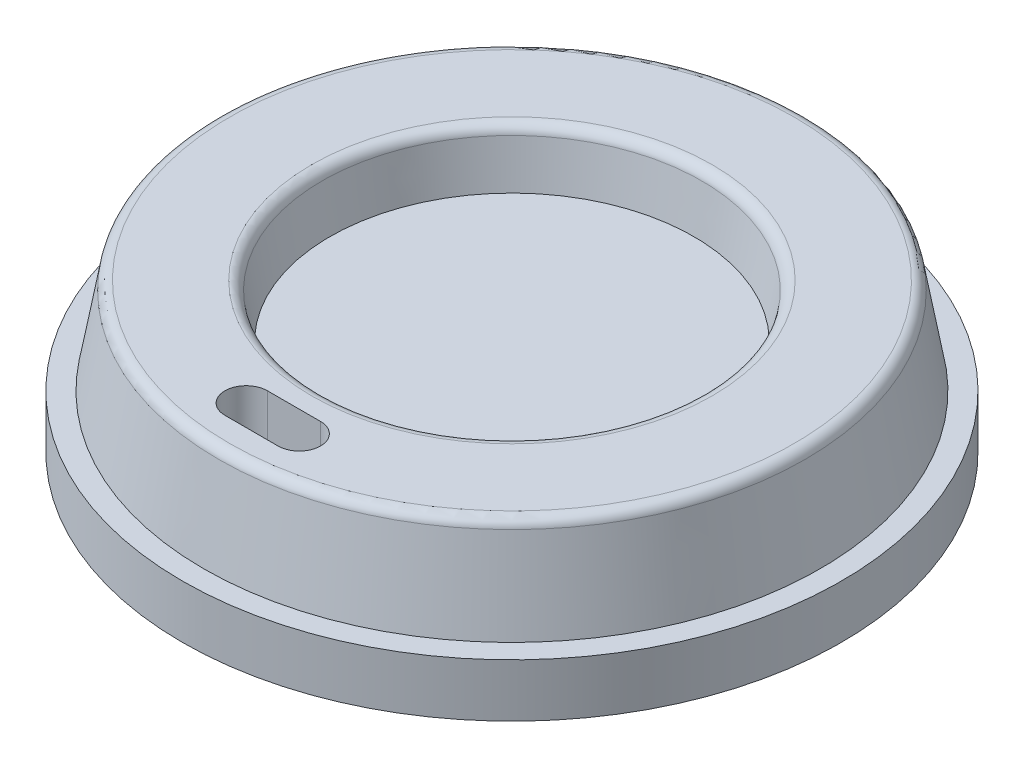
ISO-10303-21;
HEADER;
FILE_DESCRIPTION(('STEP AP214'),'2;1');
FILE_NAME('part.step','',(''),(''),'','','');
FILE_SCHEMA(('AUTOMOTIVE_DESIGN { 1 0 10303 214 1 1 1 1 }'));
ENDSEC;
DATA;
#1=APPLICATION_CONTEXT('core data for automotive mechanical design processes');
#2=APPLICATION_PROTOCOL_DEFINITION('international standard','automotive_design',2000,#1);
#3=PRODUCT_CONTEXT('',#1,'mechanical');
#4=PRODUCT('Part','Part','',(#3));
#5=PRODUCT_RELATED_PRODUCT_CATEGORY('part','',(#4));
#6=PRODUCT_DEFINITION_FORMATION('','',#4);
#7=PRODUCT_DEFINITION_CONTEXT('part definition',#1,'design');
#8=PRODUCT_DEFINITION('design','',#6,#7);
#9=PRODUCT_DEFINITION_SHAPE('','',#8);
#10=(LENGTH_UNIT() NAMED_UNIT(*) SI_UNIT(.MILLI.,.METRE.));
#11=(NAMED_UNIT(*) PLANE_ANGLE_UNIT() SI_UNIT($,.RADIAN.));
#12=(NAMED_UNIT(*) SI_UNIT($,.STERADIAN.) SOLID_ANGLE_UNIT());
#13=UNCERTAINTY_MEASURE_WITH_UNIT(LENGTH_MEASURE(1.E-05),#10,'distance_accuracy_value','');
#14=(GEOMETRIC_REPRESENTATION_CONTEXT(3) GLOBAL_UNCERTAINTY_ASSIGNED_CONTEXT((#13)) GLOBAL_UNIT_ASSIGNED_CONTEXT((#10,
#11,#12)) REPRESENTATION_CONTEXT('',''));
#15=CARTESIAN_POINT('',(0.,0.,0.));
#16=DIRECTION('',(0.,0.,1.));
#17=DIRECTION('',(1.,0.,0.));
#18=AXIS2_PLACEMENT_3D('',#15,#16,#17);
#19=CARTESIAN_POINT('',(0.,5.,0.));
#20=DIRECTION('',(0.,-1.,0.));
#21=DIRECTION('',(0.,0.,-1.));
#22=AXIS2_PLACEMENT_3D('',#19,#20,#21);
#23=CYLINDRICAL_SURFACE('',#22,23.);
#24=CARTESIAN_POINT('',(0.,0.,0.));
#25=DIRECTION('',(0.,1.,0.));
#26=DIRECTION('',(0.,0.,1.));
#27=AXIS2_PLACEMENT_3D('',#24,#25,#26);
#28=CIRCLE('',#27,23.);
#29=CARTESIAN_POINT('',(4.49922585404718,0.,22.5556415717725));
#30=VERTEX_POINT('',#29);
#31=CARTESIAN_POINT('',(-4.49922585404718,0.,22.5556415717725));
#32=VERTEX_POINT('',#31);
#33=EDGE_CURVE('E112',#30,#32,#28,.T.);
#34=ORIENTED_EDGE('',*,*,#33,.T.);
#35=DIRECTION('',(0.,1.,0.));
#36=VECTOR('',#35,1.);
#37=CARTESIAN_POINT('',(-4.49922585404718,9.5,22.5556415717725));
#38=LINE('',#37,#36);
#39=CARTESIAN_POINT('',(-4.49922585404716,5.,22.5556415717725));
#40=VERTEX_POINT('',#39);
#41=EDGE_CURVE('E137',#32,#40,#38,.T.);
#42=ORIENTED_EDGE('',*,*,#41,.T.);
#43=CARTESIAN_POINT('',(0.,5.,0.));
#44=DIRECTION('',(0.,1.,0.));
#45=DIRECTION('',(0.,0.,1.));
#46=AXIS2_PLACEMENT_3D('',#43,#44,#45);
#47=CIRCLE('',#46,23.);
#48=CARTESIAN_POINT('',(4.49922585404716,5.,22.5556415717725));
#49=VERTEX_POINT('',#48);
#50=EDGE_CURVE('E148',#49,#40,#47,.T.);
#51=ORIENTED_EDGE('',*,*,#50,.F.);
#52=DIRECTION('',(0.,1.,0.));
#53=VECTOR('',#52,1.);
#54=CARTESIAN_POINT('',(4.49922585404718,9.5,22.5556415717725));
#55=LINE('',#54,#53);
#56=EDGE_CURVE('E132',#49,#30,#55,.F.);
#57=ORIENTED_EDGE('',*,*,#56,.T.);
#58=EDGE_LOOP('',(#34,#42,#51,#57));
#59=FACE_BOUND('',#58,.T.);
#60=ADVANCED_FACE('F35',(#59),#23,.T.);
#61=CARTESIAN_POINT('',(0.,0.,0.));
#62=DIRECTION('',(0.,1.,0.));
#63=DIRECTION('',(0.,0.,1.));
#64=AXIS2_PLACEMENT_3D('',#61,#62,#63);
#65=PLANE('',#64);
#66=DIRECTION('',(-1.,0.,0.));
#67=VECTOR('',#66,1.);
#68=CARTESIAN_POINT('',(-2.5,0.,20.5));
#69=LINE('',#68,#67);
#70=CARTESIAN_POINT('',(2.5,0.,20.5));
#71=VERTEX_POINT('',#70);
#72=CARTESIAN_POINT('',(-2.5,0.,20.5));
#73=VERTEX_POINT('',#72);
#74=EDGE_CURVE('E102',#71,#73,#69,.T.);
#75=ORIENTED_EDGE('',*,*,#74,.T.);
#76=CARTESIAN_POINT('',(-2.5,0.,22.5));
#77=DIRECTION('',(0.,1.,0.));
#78=DIRECTION('',(0.,0.,1.));
#79=AXIS2_PLACEMENT_3D('',#76,#77,#78);
#80=CIRCLE('',#79,2.);
#81=EDGE_CURVE('E113',#73,#32,#80,.T.);
#82=ORIENTED_EDGE('',*,*,#81,.T.);
#83=ORIENTED_EDGE('',*,*,#33,.F.);
#84=CARTESIAN_POINT('',(2.5,0.,22.5));
#85=DIRECTION('',(0.,1.,0.));
#86=DIRECTION('',(0.,0.,1.));
#87=AXIS2_PLACEMENT_3D('',#84,#85,#86);
#88=CIRCLE('',#87,2.);
#89=EDGE_CURVE('E92',#30,#71,#88,.T.);
#90=ORIENTED_EDGE('',*,*,#89,.T.);
#91=EDGE_LOOP('',(#75,#82,#83,#90));
#92=FACE_BOUND('',#91,.T.);
#93=ADVANCED_FACE('F110',(#92),#65,.F.);
#94=CARTESIAN_POINT('',(0.,10.,0.));
#95=DIRECTION('',(0.,-1.,0.));
#96=DIRECTION('',(0.,0.,-1.));
#97=AXIS2_PLACEMENT_3D('',#94,#95,#96);
#98=CYLINDRICAL_SURFACE('',#97,31.);
#99=CARTESIAN_POINT('',(0.,10.,0.));
#100=DIRECTION('',(0.,1.,0.));
#101=DIRECTION('',(0.,0.,1.));
#102=AXIS2_PLACEMENT_3D('',#99,#100,#101);
#103=CIRCLE('',#102,31.);
#104=CARTESIAN_POINT('',(0.,10.,31.));
#105=VERTEX_POINT('',#104);
#106=EDGE_CURVE('E149',#105,#105,#103,.T.);
#107=ORIENTED_EDGE('',*,*,#106,.F.);
#108=EDGE_LOOP('',(#107));
#109=FACE_BOUND('',#108,.T.);
#110=CARTESIAN_POINT('',(0.,5.,0.));
#111=DIRECTION('',(0.,1.,0.));
#112=DIRECTION('',(0.,0.,1.));
#113=AXIS2_PLACEMENT_3D('',#110,#111,#112);
#114=CIRCLE('',#113,31.);
#115=CARTESIAN_POINT('',(0.,5.,31.));
#116=VERTEX_POINT('',#115);
#117=EDGE_CURVE('E143',#116,#116,#114,.T.);
#118=ORIENTED_EDGE('',*,*,#117,.T.);
#119=EDGE_LOOP('',(#118));
#120=FACE_BOUND('',#119,.T.);
#121=ADVANCED_FACE('F185',(#109,#120),#98,.T.);
#122=CARTESIAN_POINT('',(0.,10.,0.));
#123=DIRECTION('',(0.,1.,0.));
#124=DIRECTION('',(0.,0.,1.));
#125=AXIS2_PLACEMENT_3D('',#122,#123,#124);
#126=PLANE('',#125);
#127=CARTESIAN_POINT('',(0.,10.,0.));
#128=DIRECTION('',(0.,1.,0.));
#129=DIRECTION('',(0.,0.,1.));
#130=AXIS2_PLACEMENT_3D('',#127,#128,#129);
#131=CIRCLE('',#130,29.);
#132=CARTESIAN_POINT('',(0.,10.,29.));
#133=VERTEX_POINT('',#132);
#134=EDGE_CURVE('E144',#133,#133,#131,.T.);
#135=ORIENTED_EDGE('',*,*,#134,.F.);
#136=EDGE_LOOP('',(#135));
#137=FACE_BOUND('',#136,.T.);
#138=ORIENTED_EDGE('',*,*,#106,.T.);
#139=EDGE_LOOP('',(#138));
#140=FACE_BOUND('',#139,.T.);
#141=ADVANCED_FACE('F211',(#137,#140),#126,.T.);
#142=CARTESIAN_POINT('',(0.,5.,0.));
#143=DIRECTION('',(0.,1.,0.));
#144=DIRECTION('',(0.,0.,1.));
#145=AXIS2_PLACEMENT_3D('',#142,#143,#144);
#146=PLANE('',#145);
#147=ORIENTED_EDGE('',*,*,#50,.T.);
#148=CARTESIAN_POINT('',(-2.5,5.,22.5));
#149=DIRECTION('',(0.,1.,0.));
#150=DIRECTION('',(0.,0.,1.));
#151=AXIS2_PLACEMENT_3D('',#148,#149,#150);
#152=CIRCLE('',#151,2.);
#153=CARTESIAN_POINT('',(-2.5,5.,24.5));
#154=VERTEX_POINT('',#153);
#155=EDGE_CURVE('E134',#40,#154,#152,.T.);
#156=ORIENTED_EDGE('',*,*,#155,.T.);
#157=DIRECTION('',(1.,0.,0.));
#158=VECTOR('',#157,1.);
#159=CARTESIAN_POINT('',(0.,5.,24.5));
#160=LINE('',#159,#158);
#161=CARTESIAN_POINT('',(2.5,5.,24.5));
#162=VERTEX_POINT('',#161);
#163=EDGE_CURVE('E123',#154,#162,#160,.T.);
#164=ORIENTED_EDGE('',*,*,#163,.T.);
#165=CARTESIAN_POINT('',(2.5,5.,22.5));
#166=DIRECTION('',(0.,1.,0.));
#167=DIRECTION('',(0.,0.,1.));
#168=AXIS2_PLACEMENT_3D('',#165,#166,#167);
#169=CIRCLE('',#168,2.);
#170=EDGE_CURVE('E129',#162,#49,#169,.T.);
#171=ORIENTED_EDGE('',*,*,#170,.T.);
#172=EDGE_LOOP('',(#147,#156,#164,#171));
#173=FACE_BOUND('',#172,.T.);
#174=ORIENTED_EDGE('',*,*,#117,.F.);
#175=EDGE_LOOP('',(#174));
#176=FACE_BOUND('',#175,.T.);
#177=ADVANCED_FACE('F207',(#173,#176),#146,.F.);
#178=CARTESIAN_POINT('',(0.,10.,0.));
#179=DIRECTION('',(0.,-1.,0.));
#180=DIRECTION('',(0.,0.,1.));
#181=AXIS2_PLACEMENT_3D('',#178,#179,#180);
#182=CONICAL_SURFACE('',#181,29.,0.174532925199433);
#183=CARTESIAN_POINT('',(0.,18.1736481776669,0.));
#184=DIRECTION('',(0.,-1.,0.));
#185=DIRECTION('',(0.,0.,-1.));
#186=AXIS2_PLACEMENT_3D('',#183,#184,#185);
#187=CIRCLE('',#186,27.5587652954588);
#188=CARTESIAN_POINT('',(0.,18.1736481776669,-27.5587652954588));
#189=VERTEX_POINT('',#188);
#190=EDGE_CURVE('E159',#189,#189,#187,.T.);
#191=ORIENTED_EDGE('',*,*,#190,.T.);
#192=EDGE_LOOP('',(#191));
#193=FACE_BOUND('',#192,.T.);
#194=ORIENTED_EDGE('',*,*,#134,.T.);
#195=EDGE_LOOP('',(#194));
#196=FACE_BOUND('',#195,.T.);
#197=ADVANCED_FACE('F197',(#193,#196),#182,.T.);
#198=CARTESIAN_POINT('',(0.,19.,0.));
#199=DIRECTION('',(0.,1.,0.));
#200=DIRECTION('',(0.,0.,1.));
#201=AXIS2_PLACEMENT_3D('',#198,#199,#200);
#202=PLANE('',#201);
#203=CARTESIAN_POINT('',(-2.5,19.,22.5));
#204=DIRECTION('',(0.,1.,0.));
#205=DIRECTION('',(0.,0.,1.));
#206=AXIS2_PLACEMENT_3D('',#203,#204,#205);
#207=CIRCLE('',#206,2.);
#208=CARTESIAN_POINT('',(-2.5,19.,20.5));
#209=VERTEX_POINT('',#208);
#210=CARTESIAN_POINT('',(-2.5,19.,24.5));
#211=VERTEX_POINT('',#210);
#212=EDGE_CURVE('E58',#209,#211,#207,.T.);
#213=ORIENTED_EDGE('',*,*,#212,.F.);
#214=DIRECTION('',(-1.,0.,0.));
#215=VECTOR('',#214,1.);
#216=CARTESIAN_POINT('',(-2.5,19.,20.5));
#217=LINE('',#216,#215);
#218=CARTESIAN_POINT('',(2.5,19.,20.5));
#219=VERTEX_POINT('',#218);
#220=EDGE_CURVE('E115',#219,#209,#217,.T.);
#221=ORIENTED_EDGE('',*,*,#220,.F.);
#222=CARTESIAN_POINT('',(2.5,19.,22.5));
#223=DIRECTION('',(0.,1.,0.));
#224=DIRECTION('',(0.,0.,1.));
#225=AXIS2_PLACEMENT_3D('',#222,#223,#224);
#226=CIRCLE('',#225,2.);
#227=CARTESIAN_POINT('',(2.5,19.,24.5));
#228=VERTEX_POINT('',#227);
#229=EDGE_CURVE('E95',#228,#219,#226,.T.);
#230=ORIENTED_EDGE('',*,*,#229,.F.);
#231=DIRECTION('',(1.,0.,0.));
#232=VECTOR('',#231,1.);
#233=CARTESIAN_POINT('',(-2.5,19.,24.5));
#234=LINE('',#233,#232);
#235=EDGE_CURVE('E119',#211,#228,#234,.T.);
#236=ORIENTED_EDGE('',*,*,#235,.F.);
#237=EDGE_LOOP('',(#213,#221,#230,#236));
#238=FACE_BOUND('',#237,.T.);
#239=CARTESIAN_POINT('',(0.,19.,0.));
#240=DIRECTION('',(0.,1.,0.));
#241=DIRECTION('',(0.,0.,1.));
#242=AXIS2_PLACEMENT_3D('',#239,#240,#241);
#243=CIRCLE('',#242,18.8390996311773);
#244=CARTESIAN_POINT('',(0.,19.,18.8390996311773));
#245=VERTEX_POINT('',#244);
#246=EDGE_CURVE('E11',#245,#245,#243,.F.);
#247=ORIENTED_EDGE('',*,*,#246,.T.);
#248=EDGE_LOOP('',(#247));
#249=FACE_BOUND('',#248,.T.);
#250=CARTESIAN_POINT('',(0.,19.,0.));
#251=DIRECTION('',(0.,1.,0.));
#252=DIRECTION('',(0.,0.,1.));
#253=AXIS2_PLACEMENT_3D('',#250,#251,#252);
#254=CIRCLE('',#253,26.5739575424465);
#255=CARTESIAN_POINT('',(0.,19.,26.5739575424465));
#256=VERTEX_POINT('',#255);
#257=EDGE_CURVE('E147',#256,#256,#254,.T.);
#258=ORIENTED_EDGE('',*,*,#257,.T.);
#259=EDGE_LOOP('',(#258));
#260=FACE_BOUND('',#259,.T.);
#261=ADVANCED_FACE('F190',(#238,#249,#260),#202,.T.);
#262=CARTESIAN_POINT('',(0.,18.,0.));
#263=DIRECTION('',(0.,1.,0.));
#264=DIRECTION('',(0.,0.,1.));
#265=AXIS2_PLACEMENT_3D('',#262,#263,#264);
#266=TOROIDAL_SURFACE('',#265,26.5739575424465,1.);
#267=ORIENTED_EDGE('',*,*,#190,.F.);
#268=EDGE_LOOP('',(#267));
#269=FACE_BOUND('',#268,.T.);
#270=ORIENTED_EDGE('',*,*,#257,.F.);
#271=EDGE_LOOP('',(#270));
#272=FACE_BOUND('',#271,.T.);
#273=ADVANCED_FACE('F188',(#269,#272),#266,.T.);
#274=CARTESIAN_POINT('',(0.,19.,0.));
#275=DIRECTION('',(0.,1.,0.));
#276=DIRECTION('',(0.,0.,1.));
#277=AXIS2_PLACEMENT_3D('',#274,#275,#276);
#278=CONICAL_SURFACE('',#277,18.,0.174532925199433);
#279=CARTESIAN_POINT('',(0.,18.1736481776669,0.));
#280=DIRECTION('',(0.,1.,0.));
#281=DIRECTION('',(0.,0.,1.));
#282=AXIS2_PLACEMENT_3D('',#279,#280,#281);
#283=CIRCLE('',#282,17.8542918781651);
#284=CARTESIAN_POINT('',(0.,18.1736481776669,17.8542918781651));
#285=VERTEX_POINT('',#284);
#286=EDGE_CURVE('E43',#285,#285,#283,.T.);
#287=ORIENTED_EDGE('',*,*,#286,.T.);
#288=EDGE_LOOP('',(#287));
#289=FACE_BOUND('',#288,.T.);
#290=CARTESIAN_POINT('',(0.,14.,0.));
#291=DIRECTION('',(0.,1.,0.));
#292=DIRECTION('',(0.,0.,1.));
#293=AXIS2_PLACEMENT_3D('',#290,#291,#292);
#294=CIRCLE('',#293,17.1183650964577);
#295=CARTESIAN_POINT('',(0.,14.,17.1183650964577));
#296=VERTEX_POINT('',#295);
#297=EDGE_CURVE('E140',#296,#296,#294,.T.);
#298=ORIENTED_EDGE('',*,*,#297,.F.);
#299=EDGE_LOOP('',(#298));
#300=FACE_BOUND('',#299,.T.);
#301=ADVANCED_FACE('F164',(#289,#300),#278,.F.);
#302=CARTESIAN_POINT('',(0.,14.,0.));
#303=DIRECTION('',(0.,1.,0.));
#304=DIRECTION('',(0.,0.,1.));
#305=AXIS2_PLACEMENT_3D('',#302,#303,#304);
#306=PLANE('',#305);
#307=ORIENTED_EDGE('',*,*,#297,.T.);
#308=EDGE_LOOP('',(#307));
#309=FACE_BOUND('',#308,.T.);
#310=ADVANCED_FACE('F169',(#309),#306,.T.);
#311=CARTESIAN_POINT('',(0.,18.,0.));
#312=DIRECTION('',(0.,1.,0.));
#313=DIRECTION('',(0.,0.,1.));
#314=AXIS2_PLACEMENT_3D('',#311,#312,#313);
#315=TOROIDAL_SURFACE('',#314,18.8390996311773,1.);
#316=ORIENTED_EDGE('',*,*,#246,.F.);
#317=EDGE_LOOP('',(#316));
#318=FACE_BOUND('',#317,.T.);
#319=ORIENTED_EDGE('',*,*,#286,.F.);
#320=EDGE_LOOP('',(#319));
#321=FACE_BOUND('',#320,.T.);
#322=ADVANCED_FACE('F37',(#318,#321),#315,.T.);
#323=CARTESIAN_POINT('',(-2.5,0.,22.5));
#324=DIRECTION('',(0.,1.,0.));
#325=DIRECTION('',(0.,0.,1.));
#326=AXIS2_PLACEMENT_3D('',#323,#324,#325);
#327=CYLINDRICAL_SURFACE('',#326,2.);
#328=ORIENTED_EDGE('',*,*,#81,.F.);
#329=DIRECTION('',(0.,1.,0.));
#330=VECTOR('',#329,1.);
#331=CARTESIAN_POINT('',(-2.5,0.,20.5));
#332=LINE('',#331,#330);
#333=EDGE_CURVE('E99',#73,#209,#332,.T.);
#334=ORIENTED_EDGE('',*,*,#333,.T.);
#335=ORIENTED_EDGE('',*,*,#212,.T.);
#336=DIRECTION('',(0.,1.,0.));
#337=VECTOR('',#336,1.);
#338=CARTESIAN_POINT('',(-2.5,0.,24.5));
#339=LINE('',#338,#337);
#340=EDGE_CURVE('E107',#154,#211,#339,.T.);
#341=ORIENTED_EDGE('',*,*,#340,.F.);
#342=ORIENTED_EDGE('',*,*,#155,.F.);
#343=ORIENTED_EDGE('',*,*,#41,.F.);
#344=EDGE_LOOP('',(#328,#334,#335,#341,#342,#343));
#345=FACE_BOUND('',#344,.T.);
#346=ADVANCED_FACE('F168',(#345),#327,.F.);
#347=CARTESIAN_POINT('',(2.5,0.,22.5));
#348=DIRECTION('',(0.,1.,0.));
#349=DIRECTION('',(0.,0.,1.));
#350=AXIS2_PLACEMENT_3D('',#347,#348,#349);
#351=CYLINDRICAL_SURFACE('',#350,2.);
#352=ORIENTED_EDGE('',*,*,#170,.F.);
#353=DIRECTION('',(0.,1.,0.));
#354=VECTOR('',#353,1.);
#355=CARTESIAN_POINT('',(2.5,0.,24.5));
#356=LINE('',#355,#354);
#357=EDGE_CURVE('E50',#162,#228,#356,.T.);
#358=ORIENTED_EDGE('',*,*,#357,.T.);
#359=ORIENTED_EDGE('',*,*,#229,.T.);
#360=DIRECTION('',(0.,1.,0.));
#361=VECTOR('',#360,1.);
#362=CARTESIAN_POINT('',(2.5,0.,20.5));
#363=LINE('',#362,#361);
#364=EDGE_CURVE('E88',#71,#219,#363,.T.);
#365=ORIENTED_EDGE('',*,*,#364,.F.);
#366=ORIENTED_EDGE('',*,*,#89,.F.);
#367=ORIENTED_EDGE('',*,*,#56,.F.);
#368=EDGE_LOOP('',(#352,#358,#359,#365,#366,#367));
#369=FACE_BOUND('',#368,.T.);
#370=ADVANCED_FACE('F90',(#369),#351,.F.);
#371=CARTESIAN_POINT('',(-2.5,0.,24.5));
#372=DIRECTION('',(0.,0.,1.));
#373=DIRECTION('',(1.,0.,0.));
#374=AXIS2_PLACEMENT_3D('',#371,#372,#373);
#375=PLANE('',#374);
#376=ORIENTED_EDGE('',*,*,#340,.T.);
#377=ORIENTED_EDGE('',*,*,#235,.T.);
#378=ORIENTED_EDGE('',*,*,#357,.F.);
#379=ORIENTED_EDGE('',*,*,#163,.F.);
#380=EDGE_LOOP('',(#376,#377,#378,#379));
#381=FACE_BOUND('',#380,.T.);
#382=ADVANCED_FACE('F227',(#381),#375,.F.);
#383=CARTESIAN_POINT('',(-2.5,0.,20.5));
#384=DIRECTION('',(0.,0.,-1.));
#385=DIRECTION('',(-1.,0.,0.));
#386=AXIS2_PLACEMENT_3D('',#383,#384,#385);
#387=PLANE('',#386);
#388=ORIENTED_EDGE('',*,*,#220,.T.);
#389=ORIENTED_EDGE('',*,*,#333,.F.);
#390=ORIENTED_EDGE('',*,*,#74,.F.);
#391=ORIENTED_EDGE('',*,*,#364,.T.);
#392=EDGE_LOOP('',(#388,#389,#390,#391));
#393=FACE_BOUND('',#392,.T.);
#394=ADVANCED_FACE('F103',(#393),#387,.F.);
#395=CLOSED_SHELL('',(#60,#93,#121,#141,#177,#197,#261,#273,#301,#310,#322,#346,#370,#382,#394));
#396=MANIFOLD_SOLID_BREP('B2',#395);
#397=ADVANCED_BREP_SHAPE_REPRESENTATION('',(#18,#396),#14);
#398=SHAPE_DEFINITION_REPRESENTATION(#9,#397);
ENDSEC;
END-ISO-10303-21;
